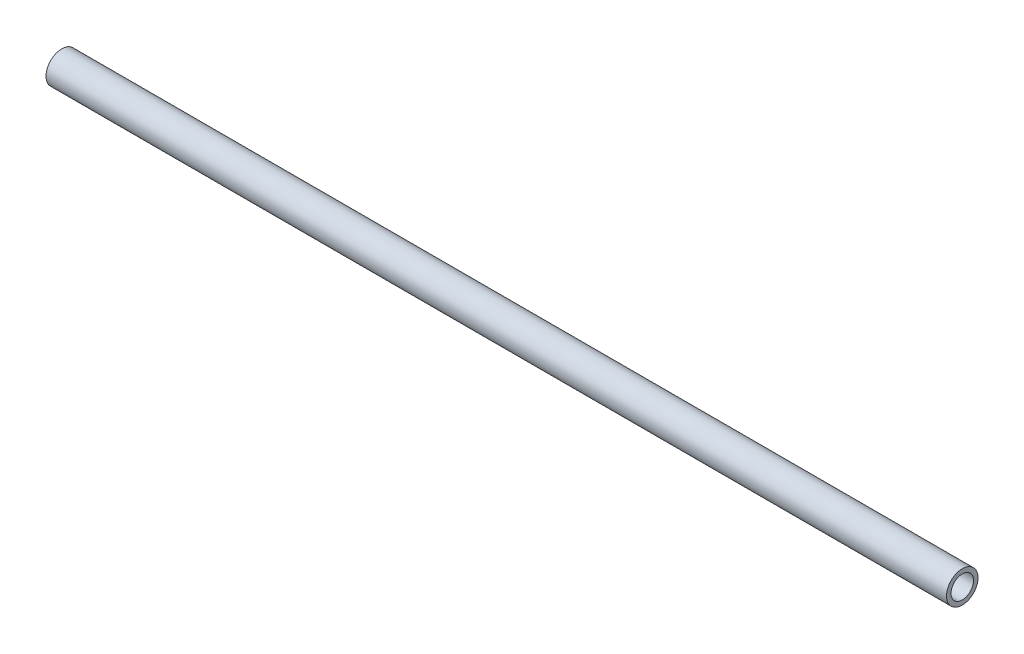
ISO-10303-21;
HEADER;
FILE_DESCRIPTION(('STEP AP214'),'2;1');
FILE_NAME('part.step','',(''),(''),'','','');
FILE_SCHEMA(('AUTOMOTIVE_DESIGN { 1 0 10303 214 1 1 1 1 }'));
ENDSEC;
DATA;
#1=APPLICATION_CONTEXT('core data for automotive mechanical design processes');
#2=APPLICATION_PROTOCOL_DEFINITION('international standard','automotive_design',2000,#1);
#3=PRODUCT_CONTEXT('',#1,'mechanical');
#4=PRODUCT('Part','Part','',(#3));
#5=PRODUCT_RELATED_PRODUCT_CATEGORY('part','',(#4));
#6=PRODUCT_DEFINITION_FORMATION('','',#4);
#7=PRODUCT_DEFINITION_CONTEXT('part definition',#1,'design');
#8=PRODUCT_DEFINITION('design','',#6,#7);
#9=PRODUCT_DEFINITION_SHAPE('','',#8);
#10=(LENGTH_UNIT() NAMED_UNIT(*) SI_UNIT(.MILLI.,.METRE.));
#11=(NAMED_UNIT(*) PLANE_ANGLE_UNIT() SI_UNIT($,.RADIAN.));
#12=(NAMED_UNIT(*) SI_UNIT($,.STERADIAN.) SOLID_ANGLE_UNIT());
#13=UNCERTAINTY_MEASURE_WITH_UNIT(LENGTH_MEASURE(1.E-05),#10,'distance_accuracy_value','');
#14=(GEOMETRIC_REPRESENTATION_CONTEXT(3) GLOBAL_UNCERTAINTY_ASSIGNED_CONTEXT((#13)) GLOBAL_UNIT_ASSIGNED_CONTEXT((#10,
#11,#12)) REPRESENTATION_CONTEXT('',''));
#15=CARTESIAN_POINT('',(0.,0.,0.));
#16=DIRECTION('',(0.,0.,1.));
#17=DIRECTION('',(1.,0.,0.));
#18=AXIS2_PLACEMENT_3D('',#15,#16,#17);
#19=CARTESIAN_POINT('',(609.6,0.,0.));
#20=DIRECTION('',(-1.,0.,0.));
#21=DIRECTION('',(0.,0.,1.));
#22=AXIS2_PLACEMENT_3D('',#19,#20,#21);
#23=CYLINDRICAL_SURFACE('',#22,7.62);
#24=CARTESIAN_POINT('',(609.6,0.,0.));
#25=DIRECTION('',(1.,0.,0.));
#26=DIRECTION('',(0.,0.,-1.));
#27=AXIS2_PLACEMENT_3D('',#24,#25,#26);
#28=CIRCLE('',#27,7.62);
#29=CARTESIAN_POINT('',(609.6,0.,7.62));
#30=VERTEX_POINT('',#29);
#31=EDGE_CURVE('E53',#30,#30,#28,.T.);
#32=CARTESIAN_POINT('',(0.,0.,0.));
#33=DIRECTION('',(1.,0.,0.));
#34=DIRECTION('',(0.,0.,-1.));
#35=AXIS2_PLACEMENT_3D('',#32,#33,#34);
#36=CIRCLE('',#35,7.62);
#37=CARTESIAN_POINT('',(0.,0.,7.62));
#38=VERTEX_POINT('',#37);
#39=EDGE_CURVE('E60',#38,#38,#36,.T.);
#40=CARTESIAN_POINT('',(609.6,0.,7.62));
#41=CARTESIAN_POINT('',(603.25,0.,7.62));
#42=CARTESIAN_POINT('',(596.9,0.,7.62));
#43=CARTESIAN_POINT('',(584.2,0.,7.62));
#44=CARTESIAN_POINT('',(577.85,0.,7.62));
#45=CARTESIAN_POINT('',(565.15,0.,7.62));
#46=CARTESIAN_POINT('',(558.8,0.,7.62));
#47=CARTESIAN_POINT('',(546.1,0.,7.62));
#48=CARTESIAN_POINT('',(539.75,0.,7.62));
#49=CARTESIAN_POINT('',(527.05,0.,7.62));
#50=CARTESIAN_POINT('',(520.7,0.,7.62));
#51=CARTESIAN_POINT('',(508.,0.,7.62));
#52=CARTESIAN_POINT('',(501.65,0.,7.62));
#53=CARTESIAN_POINT('',(488.95,0.,7.62));
#54=CARTESIAN_POINT('',(482.6,0.,7.62));
#55=CARTESIAN_POINT('',(469.9,0.,7.62));
#56=CARTESIAN_POINT('',(463.55,0.,7.62));
#57=CARTESIAN_POINT('',(450.85,0.,7.62));
#58=CARTESIAN_POINT('',(444.5,0.,7.62));
#59=CARTESIAN_POINT('',(431.8,0.,7.62));
#60=CARTESIAN_POINT('',(425.45,0.,7.62));
#61=CARTESIAN_POINT('',(412.75,0.,7.62));
#62=CARTESIAN_POINT('',(406.4,0.,7.62));
#63=CARTESIAN_POINT('',(393.7,0.,7.62));
#64=CARTESIAN_POINT('',(387.35,0.,7.62));
#65=CARTESIAN_POINT('',(374.65,0.,7.62));
#66=CARTESIAN_POINT('',(368.3,0.,7.62));
#67=CARTESIAN_POINT('',(355.6,0.,7.62));
#68=CARTESIAN_POINT('',(349.25,0.,7.62));
#69=CARTESIAN_POINT('',(336.55,0.,7.62));
#70=CARTESIAN_POINT('',(330.2,0.,7.62));
#71=CARTESIAN_POINT('',(317.5,0.,7.62));
#72=CARTESIAN_POINT('',(311.15,0.,7.62));
#73=CARTESIAN_POINT('',(298.45,0.,7.62));
#74=CARTESIAN_POINT('',(292.1,0.,7.62));
#75=CARTESIAN_POINT('',(279.4,0.,7.62));
#76=CARTESIAN_POINT('',(273.05,0.,7.62));
#77=CARTESIAN_POINT('',(260.35,0.,7.62));
#78=CARTESIAN_POINT('',(254.,0.,7.62));
#79=CARTESIAN_POINT('',(241.3,0.,7.62));
#80=CARTESIAN_POINT('',(234.95,0.,7.62));
#81=CARTESIAN_POINT('',(222.25,0.,7.62));
#82=CARTESIAN_POINT('',(215.9,0.,7.62));
#83=CARTESIAN_POINT('',(203.2,0.,7.62));
#84=CARTESIAN_POINT('',(196.85,0.,7.62));
#85=CARTESIAN_POINT('',(184.15,0.,7.62));
#86=CARTESIAN_POINT('',(177.8,0.,7.62));
#87=CARTESIAN_POINT('',(165.1,0.,7.62));
#88=CARTESIAN_POINT('',(158.75,0.,7.62));
#89=CARTESIAN_POINT('',(146.05,0.,7.62));
#90=CARTESIAN_POINT('',(139.7,0.,7.62));
#91=CARTESIAN_POINT('',(127.,0.,7.62));
#92=CARTESIAN_POINT('',(120.65,0.,7.62));
#93=CARTESIAN_POINT('',(107.95,0.,7.62));
#94=CARTESIAN_POINT('',(101.6,0.,7.62));
#95=CARTESIAN_POINT('',(88.9,0.,7.62));
#96=CARTESIAN_POINT('',(82.5500000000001,0.,7.62));
#97=CARTESIAN_POINT('',(69.85,0.,7.62));
#98=CARTESIAN_POINT('',(63.5,0.,7.62));
#99=CARTESIAN_POINT('',(50.8,0.,7.62));
#100=CARTESIAN_POINT('',(44.45,0.,7.62));
#101=CARTESIAN_POINT('',(31.75,0.,7.62));
#102=CARTESIAN_POINT('',(25.4,0.,7.62));
#103=CARTESIAN_POINT('',(12.7,0.,7.62));
#104=CARTESIAN_POINT('',(6.35000000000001,0.,7.62));
#105=CARTESIAN_POINT('',(0.,0.,7.62));
#106=B_SPLINE_CURVE_WITH_KNOTS('',3,(#40,#41,#42,#43,#44,#45,#46,#47,#48,#49,#50,#51,#52,#53,
#54,#55,#56,#57,#58,#59,#60,#61,#62,#63,#64,#65,#66,#67,#68,#69,#70,#71,#72,#73,#74,#75,#76,#77,
#78,#79,#80,#81,#82,#83,#84,#85,#86,#87,#88,#89,#90,#91,#92,#93,#94,#95,#96,#97,#98,#99,#100,
#101,#102,#103,#104,#105),.UNSPECIFIED.,.F.,.F.,(4,2,2,2,2,2,2,2,2,2,2,2,2,2,2,2,2,2,2,2,2,2,2,
2,2,2,2,2,2,2,2,2,4),(0.,19.05,38.1,57.15,76.2,95.2500000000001,114.3,133.35,152.4,171.45,190.5,
209.55,228.6,247.65,266.7,285.75,304.8,323.85,342.9,361.95,381.,400.05,419.1,438.15,457.2,
476.25,495.3,514.35,533.4,552.45,571.5,590.55,609.6),.UNSPECIFIED.);
#107=EDGE_CURVE('BSEAM45',#30,#38,#106,.T.);
#108=ORIENTED_EDGE('',*,*,#31,.T.);
#109=ORIENTED_EDGE('',*,*,#39,.F.);
#110=ORIENTED_EDGE('',*,*,#107,.T.);
#111=ORIENTED_EDGE('',*,*,#107,.F.);
#112=EDGE_LOOP('',(#108,#110,#109,#111));
#113=FACE_BOUND('',#112,.T.);
#114=ADVANCED_FACE('F45',(#113),#23,.F.);
#115=CARTESIAN_POINT('',(609.6,0.,0.));
#116=DIRECTION('',(-1.,0.,0.));
#117=DIRECTION('',(0.,0.,1.));
#118=AXIS2_PLACEMENT_3D('',#115,#116,#117);
#119=CYLINDRICAL_SURFACE('',#118,10.668);
#120=CARTESIAN_POINT('',(609.6,0.,0.));
#121=DIRECTION('',(1.,0.,0.));
#122=DIRECTION('',(0.,0.,-1.));
#123=AXIS2_PLACEMENT_3D('',#120,#121,#122);
#124=CIRCLE('',#123,10.668);
#125=CARTESIAN_POINT('',(609.6,0.,10.668));
#126=VERTEX_POINT('',#125);
#127=EDGE_CURVE('E10',#126,#126,#124,.T.);
#128=CARTESIAN_POINT('',(0.,0.,0.));
#129=DIRECTION('',(1.,0.,0.));
#130=DIRECTION('',(0.,0.,-1.));
#131=AXIS2_PLACEMENT_3D('',#128,#129,#130);
#132=CIRCLE('',#131,10.668);
#133=CARTESIAN_POINT('',(0.,0.,10.668));
#134=VERTEX_POINT('',#133);
#135=EDGE_CURVE('E48',#134,#134,#132,.T.);
#136=CARTESIAN_POINT('',(609.6,0.,10.668));
#137=CARTESIAN_POINT('',(603.25,0.,10.668));
#138=CARTESIAN_POINT('',(596.9,0.,10.668));
#139=CARTESIAN_POINT('',(584.2,0.,10.668));
#140=CARTESIAN_POINT('',(577.85,0.,10.668));
#141=CARTESIAN_POINT('',(565.15,0.,10.668));
#142=CARTESIAN_POINT('',(558.8,0.,10.668));
#143=CARTESIAN_POINT('',(546.1,0.,10.668));
#144=CARTESIAN_POINT('',(539.75,0.,10.668));
#145=CARTESIAN_POINT('',(527.05,0.,10.668));
#146=CARTESIAN_POINT('',(520.7,0.,10.668));
#147=CARTESIAN_POINT('',(508.,0.,10.668));
#148=CARTESIAN_POINT('',(501.65,0.,10.668));
#149=CARTESIAN_POINT('',(488.95,0.,10.668));
#150=CARTESIAN_POINT('',(482.6,0.,10.668));
#151=CARTESIAN_POINT('',(469.9,0.,10.668));
#152=CARTESIAN_POINT('',(463.55,0.,10.668));
#153=CARTESIAN_POINT('',(450.85,0.,10.668));
#154=CARTESIAN_POINT('',(444.5,0.,10.668));
#155=CARTESIAN_POINT('',(431.8,0.,10.668));
#156=CARTESIAN_POINT('',(425.45,0.,10.668));
#157=CARTESIAN_POINT('',(412.75,0.,10.668));
#158=CARTESIAN_POINT('',(406.4,0.,10.668));
#159=CARTESIAN_POINT('',(393.7,0.,10.668));
#160=CARTESIAN_POINT('',(387.35,0.,10.668));
#161=CARTESIAN_POINT('',(374.65,0.,10.668));
#162=CARTESIAN_POINT('',(368.3,0.,10.668));
#163=CARTESIAN_POINT('',(355.6,0.,10.668));
#164=CARTESIAN_POINT('',(349.25,0.,10.668));
#165=CARTESIAN_POINT('',(336.55,0.,10.668));
#166=CARTESIAN_POINT('',(330.2,0.,10.668));
#167=CARTESIAN_POINT('',(317.5,0.,10.668));
#168=CARTESIAN_POINT('',(311.15,0.,10.668));
#169=CARTESIAN_POINT('',(298.45,0.,10.668));
#170=CARTESIAN_POINT('',(292.1,0.,10.668));
#171=CARTESIAN_POINT('',(279.4,0.,10.668));
#172=CARTESIAN_POINT('',(273.05,0.,10.668));
#173=CARTESIAN_POINT('',(260.35,0.,10.668));
#174=CARTESIAN_POINT('',(254.,0.,10.668));
#175=CARTESIAN_POINT('',(241.3,0.,10.668));
#176=CARTESIAN_POINT('',(234.95,0.,10.668));
#177=CARTESIAN_POINT('',(222.25,0.,10.668));
#178=CARTESIAN_POINT('',(215.9,0.,10.668));
#179=CARTESIAN_POINT('',(203.2,0.,10.668));
#180=CARTESIAN_POINT('',(196.85,0.,10.668));
#181=CARTESIAN_POINT('',(184.15,0.,10.668));
#182=CARTESIAN_POINT('',(177.8,0.,10.668));
#183=CARTESIAN_POINT('',(165.1,0.,10.668));
#184=CARTESIAN_POINT('',(158.75,0.,10.668));
#185=CARTESIAN_POINT('',(146.05,0.,10.668));
#186=CARTESIAN_POINT('',(139.7,0.,10.668));
#187=CARTESIAN_POINT('',(127.,0.,10.668));
#188=CARTESIAN_POINT('',(120.65,0.,10.668));
#189=CARTESIAN_POINT('',(107.95,0.,10.668));
#190=CARTESIAN_POINT('',(101.6,0.,10.668));
#191=CARTESIAN_POINT('',(88.9,0.,10.668));
#192=CARTESIAN_POINT('',(82.5500000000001,0.,10.668));
#193=CARTESIAN_POINT('',(69.85,0.,10.668));
#194=CARTESIAN_POINT('',(63.5,0.,10.668));
#195=CARTESIAN_POINT('',(50.8,0.,10.668));
#196=CARTESIAN_POINT('',(44.45,0.,10.668));
#197=CARTESIAN_POINT('',(31.75,0.,10.668));
#198=CARTESIAN_POINT('',(25.4,0.,10.668));
#199=CARTESIAN_POINT('',(12.7,0.,10.668));
#200=CARTESIAN_POINT('',(6.35000000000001,0.,10.668));
#201=CARTESIAN_POINT('',(0.,0.,10.668));
#202=B_SPLINE_CURVE_WITH_KNOTS('',3,(#136,#137,#138,#139,#140,#141,#142,#143,#144,#145,#146,
#147,#148,#149,#150,#151,#152,#153,#154,#155,#156,#157,#158,#159,#160,#161,#162,#163,#164,#165,
#166,#167,#168,#169,#170,#171,#172,#173,#174,#175,#176,#177,#178,#179,#180,#181,#182,#183,#184,
#185,#186,#187,#188,#189,#190,#191,#192,#193,#194,#195,#196,#197,#198,#199,#200,#201),
.UNSPECIFIED.,.F.,.F.,(4,2,2,2,2,2,2,2,2,2,2,2,2,2,2,2,2,2,2,2,2,2,2,2,2,2,2,2,2,2,2,2,4),(0.,
19.0499999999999,38.0999999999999,57.1499999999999,76.1999999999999,95.2499999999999,114.3,
133.35,152.4,171.45,190.5,209.55,228.6,247.65,266.7,285.75,304.8,323.85,342.9,361.95,381.,
400.05,419.1,438.15,457.2,476.25,495.3,514.35,533.4,552.45,571.5,590.55,609.6),.UNSPECIFIED.);
#203=EDGE_CURVE('BSEAM69',#126,#134,#202,.T.);
#204=ORIENTED_EDGE('',*,*,#127,.F.);
#205=ORIENTED_EDGE('',*,*,#135,.T.);
#206=ORIENTED_EDGE('',*,*,#203,.T.);
#207=ORIENTED_EDGE('',*,*,#203,.F.);
#208=EDGE_LOOP('',(#204,#206,#205,#207));
#209=FACE_BOUND('',#208,.T.);
#210=ADVANCED_FACE('F69',(#209),#119,.T.);
#211=CARTESIAN_POINT('',(609.6,0.,0.));
#212=DIRECTION('',(1.,0.,0.));
#213=DIRECTION('',(0.,0.,-1.));
#214=AXIS2_PLACEMENT_3D('',#211,#212,#213);
#215=PLANE('',#214);
#216=ORIENTED_EDGE('',*,*,#31,.F.);
#217=EDGE_LOOP('',(#216));
#218=FACE_BOUND('',#217,.T.);
#219=ORIENTED_EDGE('',*,*,#127,.T.);
#220=EDGE_LOOP('',(#219));
#221=FACE_BOUND('',#220,.T.);
#222=ADVANCED_FACE('F73',(#218,#221),#215,.T.);
#223=CARTESIAN_POINT('',(0.,0.,0.));
#224=DIRECTION('',(1.,0.,0.));
#225=DIRECTION('',(0.,0.,-1.));
#226=AXIS2_PLACEMENT_3D('',#223,#224,#225);
#227=PLANE('',#226);
#228=ORIENTED_EDGE('',*,*,#39,.T.);
#229=EDGE_LOOP('',(#228));
#230=FACE_BOUND('',#229,.T.);
#231=ORIENTED_EDGE('',*,*,#135,.F.);
#232=EDGE_LOOP('',(#231));
#233=FACE_BOUND('',#232,.T.);
#234=ADVANCED_FACE('F71',(#230,#233),#227,.F.);
#235=CLOSED_SHELL('',(#114,#210,#222,#234));
#236=MANIFOLD_SOLID_BREP('B2',#235);
#237=ADVANCED_BREP_SHAPE_REPRESENTATION('',(#18,#236),#14);
#238=SHAPE_DEFINITION_REPRESENTATION(#9,#237);
ENDSEC;
END-ISO-10303-21;
